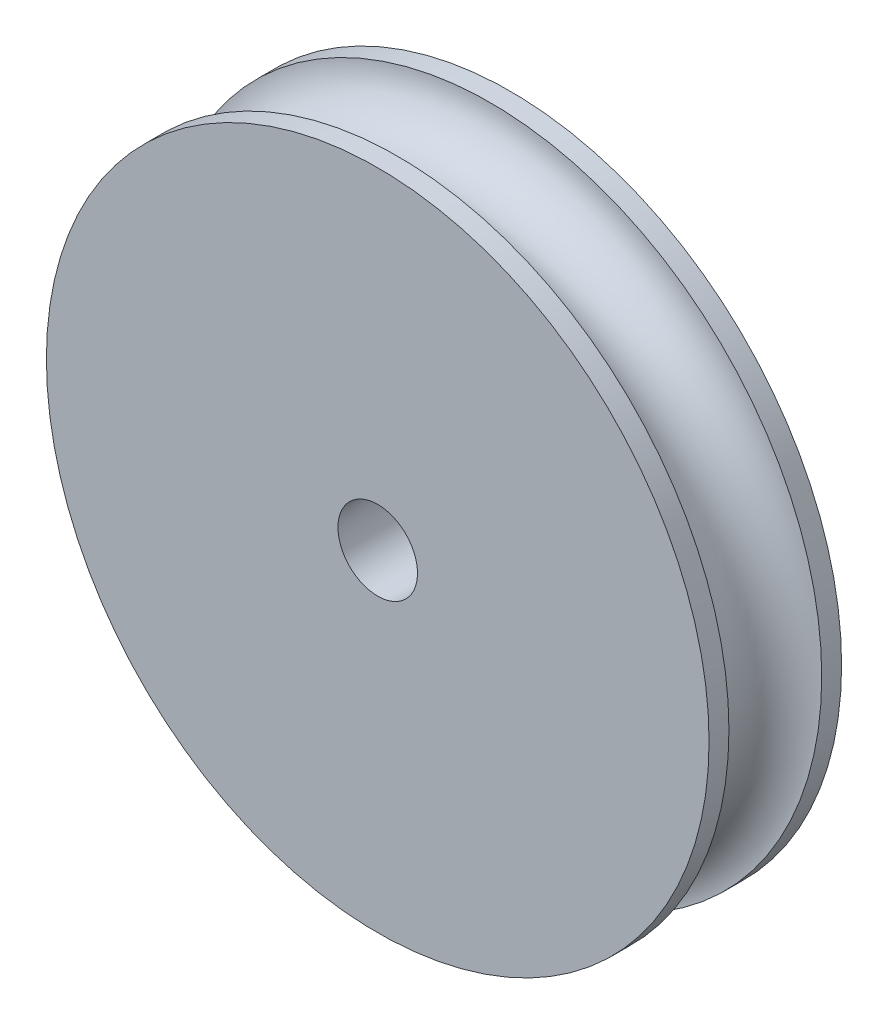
from build123d import *

# Parameters (mm, degrees)
SKETCH1_R           = 12.5
BOSS_EXTRUDE1_DEPTH = 2.5
SKETCH5_R           = 1.5
CUT_EXTRUDE1_DEPTH  = 19.371173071


with BuildPart() as part:
    # Sketch1 → Boss-Extrude1 (new, symmetric)
    with BuildSketch(Plane.XY):
        Circle(SKETCH1_R)
    extrude(amount=BOSS_EXTRUDE1_DEPTH, both=True)

    # Sketch2 → Cut-Revolve1 (revolve, cut)
    with BuildSketch(Plane(origin=(0, 0, 0), x_dir=(1, 0, 0), z_dir=(0, 1, 0)), mode=Mode.PRIVATE) as cut_revolve1_sk:
        with BuildLine():
            Line((12.5, 1.75), (12.5, -1.75))
            ThreePointArc((12.5, -1.75), (10.75, 0), (12.5, 1.75))
        make_face()
    revolve(cut_revolve1_sk.sketch.rotate(Axis((0, 0, -2.25), (0, 0, 1)), 180), axis=Axis((0, 0, -2.25), (0, 0, 1)), mode=Mode.SUBTRACT)

    # Sketch5 → Cut-Extrude1 (cut, through all)
    with BuildSketch(Plane(origin=(0, 0, -2.5), x_dir=(-1, 0, 0), z_dir=(0, 0, -1))):
        Circle(SKETCH5_R)
    extrude(amount=-CUT_EXTRUDE1_DEPTH, mode=Mode.SUBTRACT)


solid = part.part
